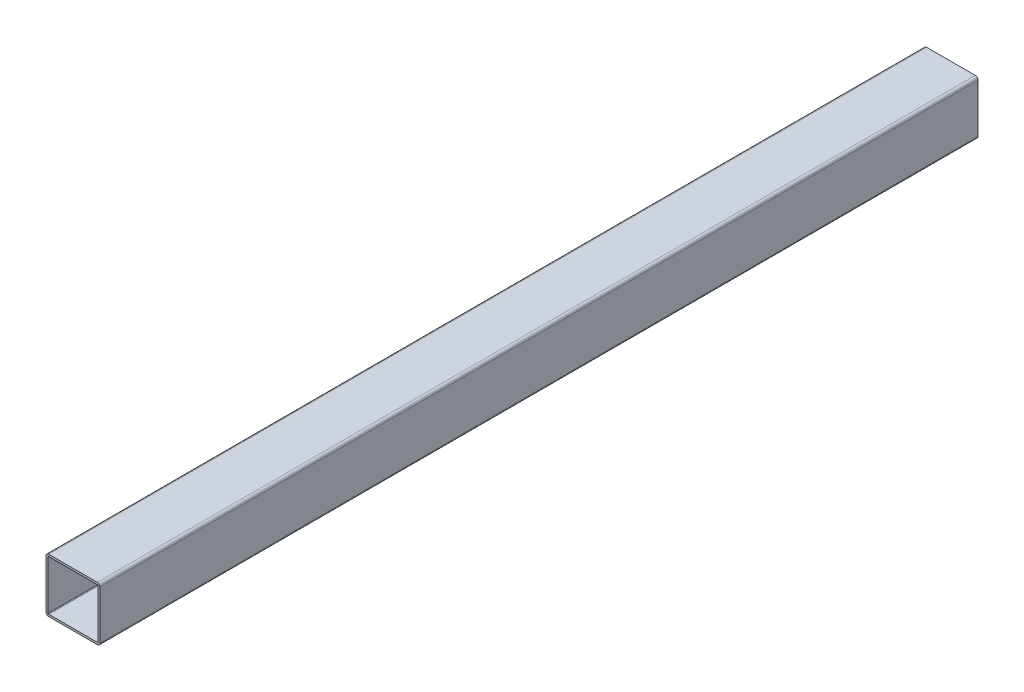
ISO-10303-21;
HEADER;
FILE_DESCRIPTION(('STEP AP214'),'2;1');
FILE_NAME('part.step','',(''),(''),'','','');
FILE_SCHEMA(('AUTOMOTIVE_DESIGN { 1 0 10303 214 1 1 1 1 }'));
ENDSEC;
DATA;
#1=APPLICATION_CONTEXT('core data for automotive mechanical design processes');
#2=APPLICATION_PROTOCOL_DEFINITION('international standard','automotive_design',2000,#1);
#3=PRODUCT_CONTEXT('',#1,'mechanical');
#4=PRODUCT('Part','Part','',(#3));
#5=PRODUCT_RELATED_PRODUCT_CATEGORY('part','',(#4));
#6=PRODUCT_DEFINITION_FORMATION('','',#4);
#7=PRODUCT_DEFINITION_CONTEXT('part definition',#1,'design');
#8=PRODUCT_DEFINITION('design','',#6,#7);
#9=PRODUCT_DEFINITION_SHAPE('','',#8);
#10=(LENGTH_UNIT() NAMED_UNIT(*) SI_UNIT(.MILLI.,.METRE.));
#11=(NAMED_UNIT(*) PLANE_ANGLE_UNIT() SI_UNIT($,.RADIAN.));
#12=(NAMED_UNIT(*) SI_UNIT($,.STERADIAN.) SOLID_ANGLE_UNIT());
#13=UNCERTAINTY_MEASURE_WITH_UNIT(LENGTH_MEASURE(1.E-05),#10,'distance_accuracy_value','');
#14=(GEOMETRIC_REPRESENTATION_CONTEXT(3) GLOBAL_UNCERTAINTY_ASSIGNED_CONTEXT((#13)) GLOBAL_UNIT_ASSIGNED_CONTEXT((#10,
#11,#12)) REPRESENTATION_CONTEXT('',''));
#15=CARTESIAN_POINT('',(0.,0.,0.));
#16=DIRECTION('',(0.,0.,1.));
#17=DIRECTION('',(1.,0.,0.));
#18=AXIS2_PLACEMENT_3D('',#15,#16,#17);
#19=CARTESIAN_POINT('',(76.,-76.,1300.));
#20=DIRECTION('',(0.,0.,1.));
#21=DIRECTION('',(1.,0.,0.));
#22=AXIS2_PLACEMENT_3D('',#19,#20,#21);
#23=PLANE('',#22);
#24=CARTESIAN_POINT('',(76.,-76.,1300.));
#25=DIRECTION('',(0.,0.,1.));
#26=DIRECTION('',(1.,0.,0.));
#27=AXIS2_PLACEMENT_3D('',#24,#25,#26);
#28=CIRCLE('',#27,4.);
#29=CARTESIAN_POINT('',(76.,-80.,1300.));
#30=VERTEX_POINT('',#29);
#31=CARTESIAN_POINT('',(80.,-76.,1300.));
#32=VERTEX_POINT('',#31);
#33=EDGE_CURVE('E222',#30,#32,#28,.T.);
#34=ORIENTED_EDGE('',*,*,#33,.T.);
#35=DIRECTION('',(0.,1.,0.));
#36=VECTOR('',#35,1.);
#37=CARTESIAN_POINT('',(80.,-4.00000000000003,1300.));
#38=LINE('',#37,#36);
#39=CARTESIAN_POINT('',(80.,-4.00000000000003,1300.));
#40=VERTEX_POINT('',#39);
#41=EDGE_CURVE('E225',#32,#40,#38,.T.);
#42=ORIENTED_EDGE('',*,*,#41,.T.);
#43=CARTESIAN_POINT('',(76.,-4.,1300.));
#44=DIRECTION('',(0.,0.,1.));
#45=DIRECTION('',(1.,0.,0.));
#46=AXIS2_PLACEMENT_3D('',#43,#44,#45);
#47=CIRCLE('',#46,4.);
#48=CARTESIAN_POINT('',(76.,0.,1300.));
#49=VERTEX_POINT('',#48);
#50=EDGE_CURVE('E227',#40,#49,#47,.T.);
#51=ORIENTED_EDGE('',*,*,#50,.T.);
#52=DIRECTION('',(-1.,0.,0.));
#53=VECTOR('',#52,1.);
#54=CARTESIAN_POINT('',(4.00000000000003,0.,1300.));
#55=LINE('',#54,#53);
#56=CARTESIAN_POINT('',(4.00000000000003,0.,1300.));
#57=VERTEX_POINT('',#56);
#58=EDGE_CURVE('E229',#49,#57,#55,.T.);
#59=ORIENTED_EDGE('',*,*,#58,.T.);
#60=CARTESIAN_POINT('',(4.,-4.,1300.));
#61=DIRECTION('',(0.,0.,1.));
#62=DIRECTION('',(1.,0.,0.));
#63=AXIS2_PLACEMENT_3D('',#60,#61,#62);
#64=CIRCLE('',#63,4.);
#65=CARTESIAN_POINT('',(0.,-4.00000000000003,1300.));
#66=VERTEX_POINT('',#65);
#67=EDGE_CURVE('E231',#57,#66,#64,.T.);
#68=ORIENTED_EDGE('',*,*,#67,.T.);
#69=DIRECTION('',(0.,-1.,0.));
#70=VECTOR('',#69,1.);
#71=CARTESIAN_POINT('',(0.,-4.00000000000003,1300.));
#72=LINE('',#71,#70);
#73=CARTESIAN_POINT('',(0.,-76.,1300.));
#74=VERTEX_POINT('',#73);
#75=EDGE_CURVE('E233',#66,#74,#72,.T.);
#76=ORIENTED_EDGE('',*,*,#75,.T.);
#77=CARTESIAN_POINT('',(4.00000000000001,-76.,1300.));
#78=DIRECTION('',(0.,0.,1.));
#79=DIRECTION('',(1.,0.,0.));
#80=AXIS2_PLACEMENT_3D('',#77,#78,#79);
#81=CIRCLE('',#80,4.);
#82=CARTESIAN_POINT('',(4.00000000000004,-80.,1300.));
#83=VERTEX_POINT('',#82);
#84=EDGE_CURVE('E235',#74,#83,#81,.T.);
#85=ORIENTED_EDGE('',*,*,#84,.T.);
#86=DIRECTION('',(1.,0.,0.));
#87=VECTOR('',#86,1.);
#88=CARTESIAN_POINT('',(4.00000000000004,-80.,1300.));
#89=LINE('',#88,#87);
#90=EDGE_CURVE('E237',#83,#30,#89,.T.);
#91=ORIENTED_EDGE('',*,*,#90,.T.);
#92=EDGE_LOOP('',(#34,#42,#51,#59,#68,#76,#85,#91));
#93=FACE_BOUND('',#92,.T.);
#94=DIRECTION('',(0.,-1.,0.));
#95=VECTOR('',#94,1.);
#96=CARTESIAN_POINT('',(3.,-4.00000000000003,1300.));
#97=LINE('',#96,#95);
#98=CARTESIAN_POINT('',(3.,-4.00000000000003,1300.));
#99=VERTEX_POINT('',#98);
#100=CARTESIAN_POINT('',(3.00000000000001,-76.,1300.));
#101=VERTEX_POINT('',#100);
#102=EDGE_CURVE('E180',#99,#101,#97,.T.);
#103=ORIENTED_EDGE('',*,*,#102,.F.);
#104=CARTESIAN_POINT('',(4.,-4.,1300.));
#105=DIRECTION('',(0.,0.,1.));
#106=DIRECTION('',(1.,0.,0.));
#107=AXIS2_PLACEMENT_3D('',#104,#105,#106);
#108=CIRCLE('',#107,0.999999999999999);
#109=CARTESIAN_POINT('',(4.00000000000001,-3.,1300.));
#110=VERTEX_POINT('',#109);
#111=EDGE_CURVE('E157',#110,#99,#108,.T.);
#112=ORIENTED_EDGE('',*,*,#111,.F.);
#113=DIRECTION('',(-1.,0.,0.));
#114=VECTOR('',#113,1.);
#115=CARTESIAN_POINT('',(4.00000000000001,-3.,1300.));
#116=LINE('',#115,#114);
#117=CARTESIAN_POINT('',(76.,-3.,1300.));
#118=VERTEX_POINT('',#117);
#119=EDGE_CURVE('E192',#118,#110,#116,.T.);
#120=ORIENTED_EDGE('',*,*,#119,.F.);
#121=CARTESIAN_POINT('',(76.,-4.,1300.));
#122=DIRECTION('',(0.,0.,1.));
#123=DIRECTION('',(1.,0.,0.));
#124=AXIS2_PLACEMENT_3D('',#121,#122,#123);
#125=CIRCLE('',#124,1.);
#126=CARTESIAN_POINT('',(77.,-4.00000000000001,1300.));
#127=VERTEX_POINT('',#126);
#128=EDGE_CURVE('E190',#127,#118,#125,.T.);
#129=ORIENTED_EDGE('',*,*,#128,.F.);
#130=DIRECTION('',(0.,1.,0.));
#131=VECTOR('',#130,1.);
#132=CARTESIAN_POINT('',(77.,-4.00000000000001,1300.));
#133=LINE('',#132,#131);
#134=CARTESIAN_POINT('',(77.,-76.,1300.));
#135=VERTEX_POINT('',#134);
#136=EDGE_CURVE('E188',#135,#127,#133,.T.);
#137=ORIENTED_EDGE('',*,*,#136,.F.);
#138=CARTESIAN_POINT('',(76.,-76.,1300.));
#139=DIRECTION('',(0.,0.,1.));
#140=DIRECTION('',(1.,0.,0.));
#141=AXIS2_PLACEMENT_3D('',#138,#139,#140);
#142=CIRCLE('',#141,1.);
#143=CARTESIAN_POINT('',(76.,-77.,1300.));
#144=VERTEX_POINT('',#143);
#145=EDGE_CURVE('E186',#144,#135,#142,.T.);
#146=ORIENTED_EDGE('',*,*,#145,.F.);
#147=DIRECTION('',(1.,0.,0.));
#148=VECTOR('',#147,1.);
#149=CARTESIAN_POINT('',(4.00000000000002,-77.,1300.));
#150=LINE('',#149,#148);
#151=CARTESIAN_POINT('',(4.00000000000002,-77.,1300.));
#152=VERTEX_POINT('',#151);
#153=EDGE_CURVE('E184',#152,#144,#150,.T.);
#154=ORIENTED_EDGE('',*,*,#153,.F.);
#155=CARTESIAN_POINT('',(4.00000000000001,-76.,1300.));
#156=DIRECTION('',(0.,0.,1.));
#157=DIRECTION('',(1.,0.,0.));
#158=AXIS2_PLACEMENT_3D('',#155,#156,#157);
#159=CIRCLE('',#158,1.);
#160=EDGE_CURVE('E182',#101,#152,#159,.T.);
#161=ORIENTED_EDGE('',*,*,#160,.F.);
#162=EDGE_LOOP('',(#103,#112,#120,#129,#137,#146,#154,#161));
#163=FACE_BOUND('',#162,.T.);
#164=ADVANCED_FACE('F29',(#93,#163),#23,.T.);
#165=CARTESIAN_POINT('',(76.,-76.,0.));
#166=DIRECTION('',(0.,0.,1.));
#167=DIRECTION('',(1.,0.,0.));
#168=AXIS2_PLACEMENT_3D('',#165,#166,#167);
#169=PLANE('',#168);
#170=CARTESIAN_POINT('',(76.,-76.,0.));
#171=DIRECTION('',(0.,0.,1.));
#172=DIRECTION('',(1.,0.,0.));
#173=AXIS2_PLACEMENT_3D('',#170,#171,#172);
#174=CIRCLE('',#173,4.);
#175=CARTESIAN_POINT('',(76.,-80.,0.));
#176=VERTEX_POINT('',#175);
#177=CARTESIAN_POINT('',(80.,-76.,0.));
#178=VERTEX_POINT('',#177);
#179=EDGE_CURVE('E158',#176,#178,#174,.T.);
#180=ORIENTED_EDGE('',*,*,#179,.F.);
#181=DIRECTION('',(1.,0.,0.));
#182=VECTOR('',#181,1.);
#183=CARTESIAN_POINT('',(4.00000000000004,-80.,0.));
#184=LINE('',#183,#182);
#185=CARTESIAN_POINT('',(4.00000000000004,-80.,0.));
#186=VERTEX_POINT('',#185);
#187=EDGE_CURVE('E220',#186,#176,#184,.T.);
#188=ORIENTED_EDGE('',*,*,#187,.F.);
#189=CARTESIAN_POINT('',(4.00000000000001,-76.,0.));
#190=DIRECTION('',(0.,0.,1.));
#191=DIRECTION('',(1.,0.,0.));
#192=AXIS2_PLACEMENT_3D('',#189,#190,#191);
#193=CIRCLE('',#192,4.);
#194=CARTESIAN_POINT('',(0.,-76.,0.));
#195=VERTEX_POINT('',#194);
#196=EDGE_CURVE('E218',#195,#186,#193,.T.);
#197=ORIENTED_EDGE('',*,*,#196,.F.);
#198=DIRECTION('',(0.,-1.,0.));
#199=VECTOR('',#198,1.);
#200=CARTESIAN_POINT('',(0.,-4.00000000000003,0.));
#201=LINE('',#200,#199);
#202=CARTESIAN_POINT('',(0.,-4.00000000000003,0.));
#203=VERTEX_POINT('',#202);
#204=EDGE_CURVE('E216',#203,#195,#201,.T.);
#205=ORIENTED_EDGE('',*,*,#204,.F.);
#206=CARTESIAN_POINT('',(4.,-4.,0.));
#207=DIRECTION('',(0.,0.,1.));
#208=DIRECTION('',(1.,0.,0.));
#209=AXIS2_PLACEMENT_3D('',#206,#207,#208);
#210=CIRCLE('',#209,4.);
#211=CARTESIAN_POINT('',(4.00000000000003,0.,0.));
#212=VERTEX_POINT('',#211);
#213=EDGE_CURVE('E214',#212,#203,#210,.T.);
#214=ORIENTED_EDGE('',*,*,#213,.F.);
#215=DIRECTION('',(-1.,0.,0.));
#216=VECTOR('',#215,1.);
#217=CARTESIAN_POINT('',(4.00000000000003,0.,0.));
#218=LINE('',#217,#216);
#219=CARTESIAN_POINT('',(76.,0.,0.));
#220=VERTEX_POINT('',#219);
#221=EDGE_CURVE('E212',#220,#212,#218,.T.);
#222=ORIENTED_EDGE('',*,*,#221,.F.);
#223=CARTESIAN_POINT('',(76.,-4.,0.));
#224=DIRECTION('',(0.,0.,1.));
#225=DIRECTION('',(1.,0.,0.));
#226=AXIS2_PLACEMENT_3D('',#223,#224,#225);
#227=CIRCLE('',#226,4.);
#228=CARTESIAN_POINT('',(80.,-4.00000000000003,0.));
#229=VERTEX_POINT('',#228);
#230=EDGE_CURVE('E210',#229,#220,#227,.T.);
#231=ORIENTED_EDGE('',*,*,#230,.F.);
#232=DIRECTION('',(0.,1.,0.));
#233=VECTOR('',#232,1.);
#234=CARTESIAN_POINT('',(80.,-4.00000000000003,0.));
#235=LINE('',#234,#233);
#236=EDGE_CURVE('E208',#178,#229,#235,.T.);
#237=ORIENTED_EDGE('',*,*,#236,.F.);
#238=EDGE_LOOP('',(#180,#188,#197,#205,#214,#222,#231,#237));
#239=FACE_BOUND('',#238,.T.);
#240=CARTESIAN_POINT('',(4.,-4.,0.));
#241=DIRECTION('',(0.,0.,1.));
#242=DIRECTION('',(1.,0.,0.));
#243=AXIS2_PLACEMENT_3D('',#240,#241,#242);
#244=CIRCLE('',#243,0.999999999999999);
#245=CARTESIAN_POINT('',(4.,-3.,0.));
#246=VERTEX_POINT('',#245);
#247=CARTESIAN_POINT('',(3.,-4.00000000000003,0.));
#248=VERTEX_POINT('',#247);
#249=EDGE_CURVE('E52',#246,#248,#244,.T.);
#250=ORIENTED_EDGE('',*,*,#249,.T.);
#251=DIRECTION('',(0.,-1.,0.));
#252=VECTOR('',#251,1.);
#253=CARTESIAN_POINT('',(3.,-4.00000000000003,0.));
#254=LINE('',#253,#252);
#255=CARTESIAN_POINT('',(3.00000000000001,-76.,0.));
#256=VERTEX_POINT('',#255);
#257=EDGE_CURVE('E144',#248,#256,#254,.T.);
#258=ORIENTED_EDGE('',*,*,#257,.T.);
#259=CARTESIAN_POINT('',(4.00000000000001,-76.,0.));
#260=DIRECTION('',(0.,0.,1.));
#261=DIRECTION('',(1.,0.,0.));
#262=AXIS2_PLACEMENT_3D('',#259,#260,#261);
#263=CIRCLE('',#262,1.);
#264=CARTESIAN_POINT('',(4.00000000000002,-77.,0.));
#265=VERTEX_POINT('',#264);
#266=EDGE_CURVE('E153',#256,#265,#263,.T.);
#267=ORIENTED_EDGE('',*,*,#266,.T.);
#268=DIRECTION('',(1.,0.,0.));
#269=VECTOR('',#268,1.);
#270=CARTESIAN_POINT('',(4.00000000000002,-77.,0.));
#271=LINE('',#270,#269);
#272=CARTESIAN_POINT('',(76.,-77.,0.));
#273=VERTEX_POINT('',#272);
#274=EDGE_CURVE('E167',#265,#273,#271,.T.);
#275=ORIENTED_EDGE('',*,*,#274,.T.);
#276=CARTESIAN_POINT('',(76.,-76.,0.));
#277=DIRECTION('',(0.,0.,1.));
#278=DIRECTION('',(1.,0.,0.));
#279=AXIS2_PLACEMENT_3D('',#276,#277,#278);
#280=CIRCLE('',#279,1.);
#281=CARTESIAN_POINT('',(77.,-76.,0.));
#282=VERTEX_POINT('',#281);
#283=EDGE_CURVE('E170',#273,#282,#280,.T.);
#284=ORIENTED_EDGE('',*,*,#283,.T.);
#285=DIRECTION('',(0.,1.,0.));
#286=VECTOR('',#285,1.);
#287=CARTESIAN_POINT('',(77.,-4.00000000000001,0.));
#288=LINE('',#287,#286);
#289=CARTESIAN_POINT('',(77.,-4.00000000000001,0.));
#290=VERTEX_POINT('',#289);
#291=EDGE_CURVE('E173',#282,#290,#288,.T.);
#292=ORIENTED_EDGE('',*,*,#291,.T.);
#293=CARTESIAN_POINT('',(76.,-4.,0.));
#294=DIRECTION('',(0.,0.,1.));
#295=DIRECTION('',(1.,0.,0.));
#296=AXIS2_PLACEMENT_3D('',#293,#294,#295);
#297=CIRCLE('',#296,1.);
#298=CARTESIAN_POINT('',(76.,-3.,0.));
#299=VERTEX_POINT('',#298);
#300=EDGE_CURVE('E176',#290,#299,#297,.T.);
#301=ORIENTED_EDGE('',*,*,#300,.T.);
#302=DIRECTION('',(-1.,0.,0.));
#303=VECTOR('',#302,1.);
#304=CARTESIAN_POINT('',(4.00000000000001,-3.,0.));
#305=LINE('',#304,#303);
#306=EDGE_CURVE('E163',#299,#246,#305,.T.);
#307=ORIENTED_EDGE('',*,*,#306,.T.);
#308=EDGE_LOOP('',(#250,#258,#267,#275,#284,#292,#301,#307));
#309=FACE_BOUND('',#308,.T.);
#310=ADVANCED_FACE('F161',(#239,#309),#169,.F.);
#311=CARTESIAN_POINT('',(76.,-76.,1300.));
#312=DIRECTION('',(0.,0.,-1.));
#313=DIRECTION('',(-1.,0.,0.));
#314=AXIS2_PLACEMENT_3D('',#311,#312,#313);
#315=CYLINDRICAL_SURFACE('',#314,4.);
#316=ORIENTED_EDGE('',*,*,#179,.T.);
#317=DIRECTION('',(0.,0.,-1.));
#318=VECTOR('',#317,1.);
#319=CARTESIAN_POINT('',(80.,-76.,1300.));
#320=LINE('',#319,#318);
#321=EDGE_CURVE('E11',#32,#178,#320,.T.);
#322=ORIENTED_EDGE('',*,*,#321,.F.);
#323=ORIENTED_EDGE('',*,*,#33,.F.);
#324=DIRECTION('',(0.,0.,-1.));
#325=VECTOR('',#324,1.);
#326=CARTESIAN_POINT('',(76.,-80.,1300.));
#327=LINE('',#326,#325);
#328=EDGE_CURVE('E239',#30,#176,#327,.T.);
#329=ORIENTED_EDGE('',*,*,#328,.T.);
#330=EDGE_LOOP('',(#316,#322,#323,#329));
#331=FACE_BOUND('',#330,.T.);
#332=ADVANCED_FACE('F31',(#331),#315,.T.);
#333=CARTESIAN_POINT('',(80.,-4.00000000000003,1300.));
#334=DIRECTION('',(-1.,0.,0.));
#335=DIRECTION('',(0.,0.,1.));
#336=AXIS2_PLACEMENT_3D('',#333,#334,#335);
#337=PLANE('',#336);
#338=ORIENTED_EDGE('',*,*,#236,.T.);
#339=DIRECTION('',(0.,0.,-1.));
#340=VECTOR('',#339,1.);
#341=CARTESIAN_POINT('',(80.,-4.00000000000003,1300.));
#342=LINE('',#341,#340);
#343=EDGE_CURVE('E37',#40,#229,#342,.T.);
#344=ORIENTED_EDGE('',*,*,#343,.F.);
#345=ORIENTED_EDGE('',*,*,#41,.F.);
#346=ORIENTED_EDGE('',*,*,#321,.T.);
#347=EDGE_LOOP('',(#338,#344,#345,#346));
#348=FACE_BOUND('',#347,.T.);
#349=ADVANCED_FACE('F283',(#348),#337,.F.);
#350=CARTESIAN_POINT('',(76.,-4.,1300.));
#351=DIRECTION('',(0.,0.,-1.));
#352=DIRECTION('',(-1.,0.,0.));
#353=AXIS2_PLACEMENT_3D('',#350,#351,#352);
#354=CYLINDRICAL_SURFACE('',#353,4.);
#355=ORIENTED_EDGE('',*,*,#230,.T.);
#356=DIRECTION('',(0.,0.,-1.));
#357=VECTOR('',#356,1.);
#358=CARTESIAN_POINT('',(76.,0.,1300.));
#359=LINE('',#358,#357);
#360=EDGE_CURVE('E254',#49,#220,#359,.T.);
#361=ORIENTED_EDGE('',*,*,#360,.F.);
#362=ORIENTED_EDGE('',*,*,#50,.F.);
#363=ORIENTED_EDGE('',*,*,#343,.T.);
#364=EDGE_LOOP('',(#355,#361,#362,#363));
#365=FACE_BOUND('',#364,.T.);
#366=ADVANCED_FACE('F261',(#365),#354,.T.);
#367=CARTESIAN_POINT('',(4.00000000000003,0.,1300.));
#368=DIRECTION('',(0.,-1.,0.));
#369=DIRECTION('',(0.,0.,-1.));
#370=AXIS2_PLACEMENT_3D('',#367,#368,#369);
#371=PLANE('',#370);
#372=ORIENTED_EDGE('',*,*,#221,.T.);
#373=DIRECTION('',(0.,0.,-1.));
#374=VECTOR('',#373,1.);
#375=CARTESIAN_POINT('',(4.00000000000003,0.,1300.));
#376=LINE('',#375,#374);
#377=EDGE_CURVE('E251',#57,#212,#376,.T.);
#378=ORIENTED_EDGE('',*,*,#377,.F.);
#379=ORIENTED_EDGE('',*,*,#58,.F.);
#380=ORIENTED_EDGE('',*,*,#360,.T.);
#381=EDGE_LOOP('',(#372,#378,#379,#380));
#382=FACE_BOUND('',#381,.T.);
#383=ADVANCED_FACE('F271',(#382),#371,.F.);
#384=CARTESIAN_POINT('',(4.,-4.,1300.));
#385=DIRECTION('',(0.,0.,-1.));
#386=DIRECTION('',(-1.,0.,0.));
#387=AXIS2_PLACEMENT_3D('',#384,#385,#386);
#388=CYLINDRICAL_SURFACE('',#387,4.);
#389=ORIENTED_EDGE('',*,*,#213,.T.);
#390=DIRECTION('',(0.,0.,-1.));
#391=VECTOR('',#390,1.);
#392=CARTESIAN_POINT('',(0.,-4.00000000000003,1300.));
#393=LINE('',#392,#391);
#394=EDGE_CURVE('E248',#66,#203,#393,.T.);
#395=ORIENTED_EDGE('',*,*,#394,.F.);
#396=ORIENTED_EDGE('',*,*,#67,.F.);
#397=ORIENTED_EDGE('',*,*,#377,.T.);
#398=EDGE_LOOP('',(#389,#395,#396,#397));
#399=FACE_BOUND('',#398,.T.);
#400=ADVANCED_FACE('F275',(#399),#388,.T.);
#401=CARTESIAN_POINT('',(0.,-4.00000000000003,1300.));
#402=DIRECTION('',(1.,0.,0.));
#403=DIRECTION('',(0.,1.,0.));
#404=AXIS2_PLACEMENT_3D('',#401,#402,#403);
#405=PLANE('',#404);
#406=ORIENTED_EDGE('',*,*,#204,.T.);
#407=DIRECTION('',(0.,0.,-1.));
#408=VECTOR('',#407,1.);
#409=CARTESIAN_POINT('',(0.,-76.,1300.));
#410=LINE('',#409,#408);
#411=EDGE_CURVE('E245',#74,#195,#410,.T.);
#412=ORIENTED_EDGE('',*,*,#411,.F.);
#413=ORIENTED_EDGE('',*,*,#75,.F.);
#414=ORIENTED_EDGE('',*,*,#394,.T.);
#415=EDGE_LOOP('',(#406,#412,#413,#414));
#416=FACE_BOUND('',#415,.T.);
#417=ADVANCED_FACE('F296',(#416),#405,.F.);
#418=CARTESIAN_POINT('',(4.00000000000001,-76.,1300.));
#419=DIRECTION('',(0.,0.,-1.));
#420=DIRECTION('',(-1.,0.,0.));
#421=AXIS2_PLACEMENT_3D('',#418,#419,#420);
#422=CYLINDRICAL_SURFACE('',#421,4.);
#423=ORIENTED_EDGE('',*,*,#196,.T.);
#424=DIRECTION('',(0.,0.,-1.));
#425=VECTOR('',#424,1.);
#426=CARTESIAN_POINT('',(4.00000000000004,-80.,1300.));
#427=LINE('',#426,#425);
#428=EDGE_CURVE('E242',#83,#186,#427,.T.);
#429=ORIENTED_EDGE('',*,*,#428,.F.);
#430=ORIENTED_EDGE('',*,*,#84,.F.);
#431=ORIENTED_EDGE('',*,*,#411,.T.);
#432=EDGE_LOOP('',(#423,#429,#430,#431));
#433=FACE_BOUND('',#432,.T.);
#434=ADVANCED_FACE('F294',(#433),#422,.T.);
#435=CARTESIAN_POINT('',(4.00000000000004,-80.,1300.));
#436=DIRECTION('',(0.,1.,0.));
#437=DIRECTION('',(0.,0.,1.));
#438=AXIS2_PLACEMENT_3D('',#435,#436,#437);
#439=PLANE('',#438);
#440=ORIENTED_EDGE('',*,*,#187,.T.);
#441=ORIENTED_EDGE('',*,*,#328,.F.);
#442=ORIENTED_EDGE('',*,*,#90,.F.);
#443=ORIENTED_EDGE('',*,*,#428,.T.);
#444=EDGE_LOOP('',(#440,#441,#442,#443));
#445=FACE_BOUND('',#444,.T.);
#446=ADVANCED_FACE('F289',(#445),#439,.F.);
#447=CARTESIAN_POINT('',(4.,-4.,1300.));
#448=DIRECTION('',(0.,0.,-1.));
#449=DIRECTION('',(-1.,0.,0.));
#450=AXIS2_PLACEMENT_3D('',#447,#448,#449);
#451=CYLINDRICAL_SURFACE('',#450,0.999999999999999);
#452=ORIENTED_EDGE('',*,*,#249,.F.);
#453=DIRECTION('',(0.,0.,-1.));
#454=VECTOR('',#453,1.);
#455=CARTESIAN_POINT('',(4.00000000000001,-3.,1300.));
#456=LINE('',#455,#454);
#457=EDGE_CURVE('E194',#110,#246,#456,.T.);
#458=ORIENTED_EDGE('',*,*,#457,.F.);
#459=ORIENTED_EDGE('',*,*,#111,.T.);
#460=DIRECTION('',(0.,0.,-1.));
#461=VECTOR('',#460,1.);
#462=CARTESIAN_POINT('',(3.,-4.00000000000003,1300.));
#463=LINE('',#462,#461);
#464=EDGE_CURVE('E146',#99,#248,#463,.T.);
#465=ORIENTED_EDGE('',*,*,#464,.T.);
#466=EDGE_LOOP('',(#452,#458,#459,#465));
#467=FACE_BOUND('',#466,.T.);
#468=ADVANCED_FACE('F155',(#467),#451,.F.);
#469=CARTESIAN_POINT('',(3.,-4.00000000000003,1300.));
#470=DIRECTION('',(1.,0.,0.));
#471=DIRECTION('',(0.,1.,0.));
#472=AXIS2_PLACEMENT_3D('',#469,#470,#471);
#473=PLANE('',#472);
#474=ORIENTED_EDGE('',*,*,#257,.F.);
#475=ORIENTED_EDGE('',*,*,#464,.F.);
#476=ORIENTED_EDGE('',*,*,#102,.T.);
#477=DIRECTION('',(0.,0.,-1.));
#478=VECTOR('',#477,1.);
#479=CARTESIAN_POINT('',(3.00000000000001,-76.,1300.));
#480=LINE('',#479,#478);
#481=EDGE_CURVE('E149',#101,#256,#480,.T.);
#482=ORIENTED_EDGE('',*,*,#481,.T.);
#483=EDGE_LOOP('',(#474,#475,#476,#482));
#484=FACE_BOUND('',#483,.T.);
#485=ADVANCED_FACE('F145',(#484),#473,.T.);
#486=CARTESIAN_POINT('',(4.00000000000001,-76.,1300.));
#487=DIRECTION('',(0.,0.,-1.));
#488=DIRECTION('',(-1.,0.,0.));
#489=AXIS2_PLACEMENT_3D('',#486,#487,#488);
#490=CYLINDRICAL_SURFACE('',#489,1.);
#491=ORIENTED_EDGE('',*,*,#266,.F.);
#492=ORIENTED_EDGE('',*,*,#481,.F.);
#493=ORIENTED_EDGE('',*,*,#160,.T.);
#494=DIRECTION('',(0.,0.,-1.));
#495=VECTOR('',#494,1.);
#496=CARTESIAN_POINT('',(4.00000000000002,-77.,1300.));
#497=LINE('',#496,#495);
#498=EDGE_CURVE('E203',#152,#265,#497,.T.);
#499=ORIENTED_EDGE('',*,*,#498,.T.);
#500=EDGE_LOOP('',(#491,#492,#493,#499));
#501=FACE_BOUND('',#500,.T.);
#502=ADVANCED_FACE('F320',(#501),#490,.F.);
#503=CARTESIAN_POINT('',(4.00000000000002,-77.,1300.));
#504=DIRECTION('',(0.,1.,0.));
#505=DIRECTION('',(0.,0.,1.));
#506=AXIS2_PLACEMENT_3D('',#503,#504,#505);
#507=PLANE('',#506);
#508=ORIENTED_EDGE('',*,*,#274,.F.);
#509=ORIENTED_EDGE('',*,*,#498,.F.);
#510=ORIENTED_EDGE('',*,*,#153,.T.);
#511=DIRECTION('',(0.,0.,-1.));
#512=VECTOR('',#511,1.);
#513=CARTESIAN_POINT('',(76.,-77.,1300.));
#514=LINE('',#513,#512);
#515=EDGE_CURVE('E201',#144,#273,#514,.T.);
#516=ORIENTED_EDGE('',*,*,#515,.T.);
#517=EDGE_LOOP('',(#508,#509,#510,#516));
#518=FACE_BOUND('',#517,.T.);
#519=ADVANCED_FACE('F325',(#518),#507,.T.);
#520=CARTESIAN_POINT('',(76.,-76.,1300.));
#521=DIRECTION('',(0.,0.,-1.));
#522=DIRECTION('',(-1.,0.,0.));
#523=AXIS2_PLACEMENT_3D('',#520,#521,#522);
#524=CYLINDRICAL_SURFACE('',#523,1.);
#525=ORIENTED_EDGE('',*,*,#283,.F.);
#526=ORIENTED_EDGE('',*,*,#515,.F.);
#527=ORIENTED_EDGE('',*,*,#145,.T.);
#528=DIRECTION('',(0.,0.,-1.));
#529=VECTOR('',#528,1.);
#530=CARTESIAN_POINT('',(77.,-76.,1300.));
#531=LINE('',#530,#529);
#532=EDGE_CURVE('E199',#135,#282,#531,.T.);
#533=ORIENTED_EDGE('',*,*,#532,.T.);
#534=EDGE_LOOP('',(#525,#526,#527,#533));
#535=FACE_BOUND('',#534,.T.);
#536=ADVANCED_FACE('F329',(#535),#524,.F.);
#537=CARTESIAN_POINT('',(77.,-4.00000000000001,1300.));
#538=DIRECTION('',(-1.,0.,0.));
#539=DIRECTION('',(0.,0.,1.));
#540=AXIS2_PLACEMENT_3D('',#537,#538,#539);
#541=PLANE('',#540);
#542=ORIENTED_EDGE('',*,*,#291,.F.);
#543=ORIENTED_EDGE('',*,*,#532,.F.);
#544=ORIENTED_EDGE('',*,*,#136,.T.);
#545=DIRECTION('',(0.,0.,-1.));
#546=VECTOR('',#545,1.);
#547=CARTESIAN_POINT('',(77.,-4.00000000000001,1300.));
#548=LINE('',#547,#546);
#549=EDGE_CURVE('E197',#127,#290,#548,.T.);
#550=ORIENTED_EDGE('',*,*,#549,.T.);
#551=EDGE_LOOP('',(#542,#543,#544,#550));
#552=FACE_BOUND('',#551,.T.);
#553=ADVANCED_FACE('F333',(#552),#541,.T.);
#554=CARTESIAN_POINT('',(76.,-4.,1300.));
#555=DIRECTION('',(0.,0.,-1.));
#556=DIRECTION('',(-1.,0.,0.));
#557=AXIS2_PLACEMENT_3D('',#554,#555,#556);
#558=CYLINDRICAL_SURFACE('',#557,1.);
#559=ORIENTED_EDGE('',*,*,#300,.F.);
#560=ORIENTED_EDGE('',*,*,#549,.F.);
#561=ORIENTED_EDGE('',*,*,#128,.T.);
#562=DIRECTION('',(0.,0.,-1.));
#563=VECTOR('',#562,1.);
#564=CARTESIAN_POINT('',(76.,-3.,1300.));
#565=LINE('',#564,#563);
#566=EDGE_CURVE('E44',#118,#299,#565,.T.);
#567=ORIENTED_EDGE('',*,*,#566,.T.);
#568=EDGE_LOOP('',(#559,#560,#561,#567));
#569=FACE_BOUND('',#568,.T.);
#570=ADVANCED_FACE('F337',(#569),#558,.F.);
#571=CARTESIAN_POINT('',(4.00000000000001,-3.,1300.));
#572=DIRECTION('',(0.,-1.,0.));
#573=DIRECTION('',(0.,0.,-1.));
#574=AXIS2_PLACEMENT_3D('',#571,#572,#573);
#575=PLANE('',#574);
#576=ORIENTED_EDGE('',*,*,#306,.F.);
#577=ORIENTED_EDGE('',*,*,#566,.F.);
#578=ORIENTED_EDGE('',*,*,#119,.T.);
#579=ORIENTED_EDGE('',*,*,#457,.T.);
#580=EDGE_LOOP('',(#576,#577,#578,#579));
#581=FACE_BOUND('',#580,.T.);
#582=ADVANCED_FACE('F341',(#581),#575,.T.);
#583=CLOSED_SHELL('',(#164,#310,#332,#349,#366,#383,#400,#417,#434,#446,#468,#485,#502,#519,
#536,#553,#570,#582));
#584=MANIFOLD_SOLID_BREP('B2',#583);
#585=ADVANCED_BREP_SHAPE_REPRESENTATION('',(#18,#584),#14);
#586=SHAPE_DEFINITION_REPRESENTATION(#9,#585);
ENDSEC;
END-ISO-10303-21;
